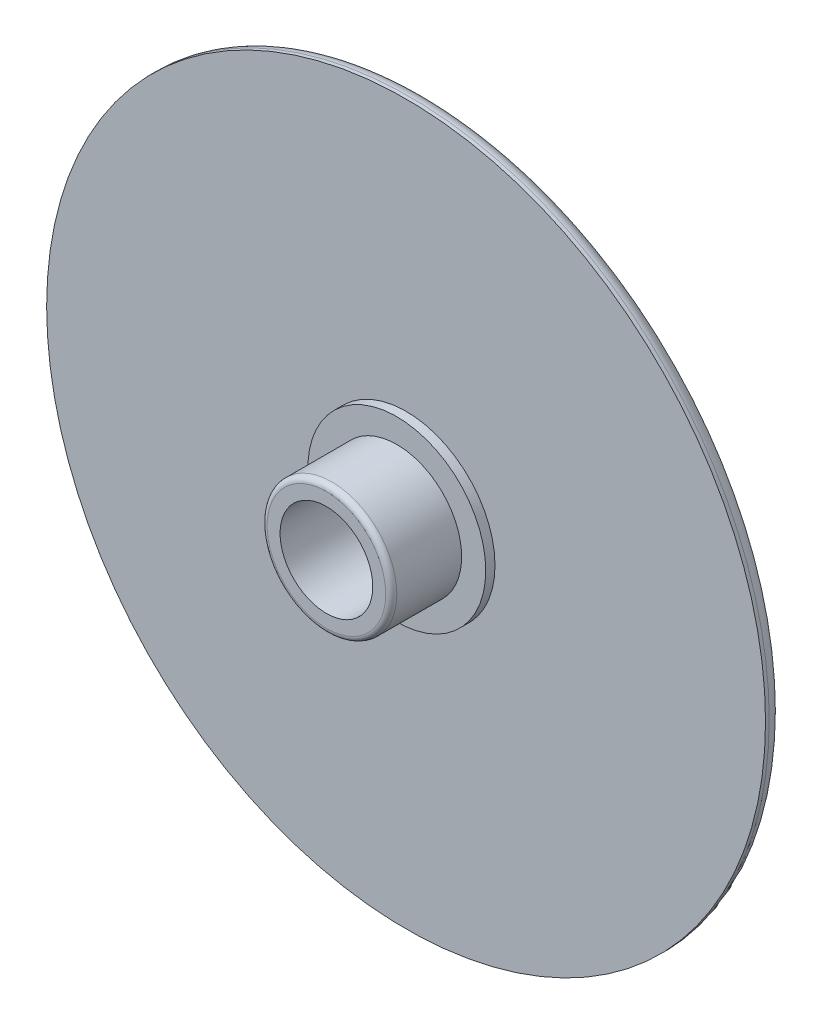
from build123d import *

# Parameters (mm, degrees)
ESQUISSE1_R             = 19.4
BASE_EXTRUSION_DEPTH    = 1
CONG_1_R                = 0.8
ESQUISSE2_R             = 4.8
BOSS_EXTRU_1_DEPTH      = 0.5
ESQUISSE3_R             = 3.5
BOSS_EXTRU_2_DEPTH      = 3.8
CONG_2_R                = 0.3
ESQUISSE4_R             = 2.5
ENL_V_MAT_EXTRU_1_DEPTH = 28.94297772


with BuildPart() as part:
    # Esquisse1 → Base-Extrusion (new body)
    with BuildSketch(Plane.XY):
        Circle(ESQUISSE1_R)
    extrude(amount=BASE_EXTRUSION_DEPTH)

    # Cong_1
    cong_1_edges = [part.edges().sort_by_distance(p)[0] for p in [
        (-19.4, 0, 0),
    ]]
    fillet(cong_1_edges, radius=CONG_1_R)

    # Esquisse2 → Boss.-Extru.1 (add)
    with BuildSketch(Plane.XY.offset(1)):
        Circle(ESQUISSE2_R)
    extrude(amount=BOSS_EXTRU_1_DEPTH)

    # Esquisse3 → Boss.-Extru.2 (add)
    with BuildSketch(Plane.XY.offset(1.5)):
        with Locations(Location((0, 0, 0), (0, 0, 180))):
            Circle(ESQUISSE3_R)
    extrude(amount=BOSS_EXTRU_2_DEPTH)

    # Cong_2
    cong_2_edges = [part.edges().sort_by_distance(p)[0] for p in [
        (3.5, 0, 5.3),
    ]]
    fillet(cong_2_edges, radius=CONG_2_R)

    # Esquisse4 → Enl_v. mat.-Extru.1 (cut, through all)
    with BuildSketch(Plane.XY.offset(5.3)):
        Circle(ESQUISSE4_R)
    extrude(amount=-ENL_V_MAT_EXTRU_1_DEPTH, mode=Mode.SUBTRACT)


solid = part.part
